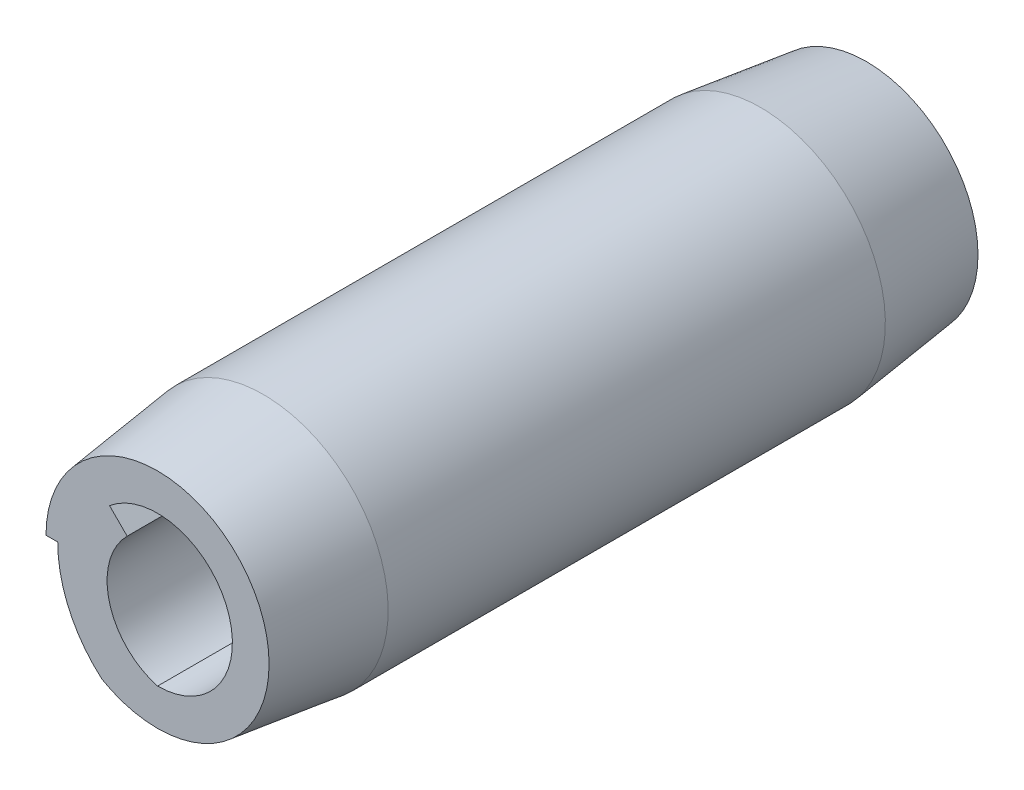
ISO-10303-21;
HEADER;
FILE_DESCRIPTION(('STEP AP214'),'2;1');
FILE_NAME('part.step','',(''),(''),'','','');
FILE_SCHEMA(('AUTOMOTIVE_DESIGN { 1 0 10303 214 1 1 1 1 }'));
ENDSEC;
DATA;
#1=APPLICATION_CONTEXT('core data for automotive mechanical design processes');
#2=APPLICATION_PROTOCOL_DEFINITION('international standard','automotive_design',2000,#1);
#3=PRODUCT_CONTEXT('',#1,'mechanical');
#4=PRODUCT('Part','Part','',(#3));
#5=PRODUCT_RELATED_PRODUCT_CATEGORY('part','',(#4));
#6=PRODUCT_DEFINITION_FORMATION('','',#4);
#7=PRODUCT_DEFINITION_CONTEXT('part definition',#1,'design');
#8=PRODUCT_DEFINITION('design','',#6,#7);
#9=PRODUCT_DEFINITION_SHAPE('','',#8);
#10=(LENGTH_UNIT() NAMED_UNIT(*) SI_UNIT(.MILLI.,.METRE.));
#11=(NAMED_UNIT(*) PLANE_ANGLE_UNIT() SI_UNIT($,.RADIAN.));
#12=(NAMED_UNIT(*) SI_UNIT($,.STERADIAN.) SOLID_ANGLE_UNIT());
#13=UNCERTAINTY_MEASURE_WITH_UNIT(LENGTH_MEASURE(1.E-05),#10,'distance_accuracy_value','');
#14=(GEOMETRIC_REPRESENTATION_CONTEXT(3) GLOBAL_UNCERTAINTY_ASSIGNED_CONTEXT((#13)) GLOBAL_UNIT_ASSIGNED_CONTEXT((#10,
#11,#12)) REPRESENTATION_CONTEXT('',''));
#15=CARTESIAN_POINT('',(0.,0.,0.));
#16=DIRECTION('',(0.,0.,1.));
#17=DIRECTION('',(1.,0.,0.));
#18=AXIS2_PLACEMENT_3D('',#15,#16,#17);
#19=CARTESIAN_POINT('',(0.,0.,2.38125));
#20=DIRECTION('',(0.,0.,-1.));
#21=DIRECTION('',(-1.,0.,0.));
#22=AXIS2_PLACEMENT_3D('',#19,#20,#21);
#23=PLANE('',#22);
#24=CARTESIAN_POINT('',(0.,0.,2.38125));
#25=DIRECTION('',(0.,0.,1.));
#26=DIRECTION('',(-1.,0.,0.));
#27=AXIS2_PLACEMENT_3D('',#24,#25,#26);
#28=CIRCLE('',#27,0.50292);
#29=CARTESIAN_POINT('',(0.,-0.50292,2.38125));
#30=VERTEX_POINT('',#29);
#31=CARTESIAN_POINT('',(-0.322595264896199,0.385824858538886,2.38125));
#32=VERTEX_POINT('',#31);
#33=EDGE_CURVE('E188',#30,#32,#28,.T.);
#34=ORIENTED_EDGE('',*,*,#33,.F.);
#35=CARTESIAN_POINT('',(0.121757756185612,-0.0585281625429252,2.38125));
#36=DIRECTION('',(0.,0.,1.));
#37=DIRECTION('',(-1.,0.,0.));
#38=AXIS2_PLACEMENT_3D('',#35,#36,#37);
#39=CIRCLE('',#38,0.460770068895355);
#40=CARTESIAN_POINT('',(-0.204055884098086,0.267285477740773,2.38125));
#41=VERTEX_POINT('',#40);
#42=EDGE_CURVE('E197',#41,#30,#39,.T.);
#43=ORIENTED_EDGE('',*,*,#42,.F.);
#44=DIRECTION('',(0.707106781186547,-0.707106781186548,0.));
#45=VECTOR('',#44,1.);
#46=CARTESIAN_POINT('',(-0.322595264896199,0.385824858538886,2.38125));
#47=LINE('',#46,#45);
#48=EDGE_CURVE('E190',#32,#41,#47,.T.);
#49=ORIENTED_EDGE('',*,*,#48,.F.);
#50=EDGE_LOOP('',(#34,#43,#49));
#51=FACE_BOUND('',#50,.T.);
#52=CARTESIAN_POINT('',(0.188595,0.,2.38125));
#53=DIRECTION('',(0.,0.,1.));
#54=DIRECTION('',(-1.,0.,0.));
#55=AXIS2_PLACEMENT_3D('',#52,#53,#54);
#56=CIRCLE('',#55,0.859155);
#57=CARTESIAN_POINT('',(-0.67056,0.,2.38125));
#58=VERTEX_POINT('',#57);
#59=CARTESIAN_POINT('',(-0.37415824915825,-0.649196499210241,2.38125));
#60=VERTEX_POINT('',#59);
#61=EDGE_CURVE('E138',#58,#60,#56,.T.);
#62=ORIENTED_EDGE('',*,*,#61,.T.);
#63=CARTESIAN_POINT('',(0.,0.,2.38125));
#64=DIRECTION('',(0.,0.,-1.));
#65=DIRECTION('',(-1.,0.,0.));
#66=AXIS2_PLACEMENT_3D('',#63,#64,#65);
#67=CIRCLE('',#66,0.7493);
#68=CARTESIAN_POINT('',(-0.7493,0.,2.38125));
#69=VERTEX_POINT('',#68);
#70=EDGE_CURVE('E60',#69,#60,#67,.T.);
#71=ORIENTED_EDGE('',*,*,#70,.F.);
#72=DIRECTION('',(1.,0.,0.));
#73=VECTOR('',#72,1.);
#74=CARTESIAN_POINT('',(-0.8382,0.,2.38125));
#75=LINE('',#74,#73);
#76=EDGE_CURVE('E132',#69,#58,#75,.T.);
#77=ORIENTED_EDGE('',*,*,#76,.T.);
#78=EDGE_LOOP('',(#62,#71,#77));
#79=FACE_BOUND('',#78,.T.);
#80=ADVANCED_FACE('F39',(#51,#79),#23,.F.);
#81=CARTESIAN_POINT('',(0.,0.,-2.38125));
#82=DIRECTION('',(0.,0.,-1.));
#83=DIRECTION('',(-1.,0.,0.));
#84=AXIS2_PLACEMENT_3D('',#81,#82,#83);
#85=PLANE('',#84);
#86=CARTESIAN_POINT('',(0.121757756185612,-0.0585281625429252,-2.38125));
#87=DIRECTION('',(0.,0.,1.));
#88=DIRECTION('',(-1.,0.,0.));
#89=AXIS2_PLACEMENT_3D('',#86,#87,#88);
#90=CIRCLE('',#89,0.460770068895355);
#91=CARTESIAN_POINT('',(-0.204055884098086,0.267285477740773,-2.38125));
#92=VERTEX_POINT('',#91);
#93=CARTESIAN_POINT('',(0.,-0.50292,-2.38125));
#94=VERTEX_POINT('',#93);
#95=EDGE_CURVE('E184',#92,#94,#90,.T.);
#96=ORIENTED_EDGE('',*,*,#95,.T.);
#97=CARTESIAN_POINT('',(0.,0.,-2.38125));
#98=DIRECTION('',(0.,0.,1.));
#99=DIRECTION('',(-1.,0.,0.));
#100=AXIS2_PLACEMENT_3D('',#97,#98,#99);
#101=CIRCLE('',#100,0.50292);
#102=CARTESIAN_POINT('',(-0.322595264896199,0.385824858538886,-2.38125));
#103=VERTEX_POINT('',#102);
#104=EDGE_CURVE('E185',#94,#103,#101,.T.);
#105=ORIENTED_EDGE('',*,*,#104,.T.);
#106=DIRECTION('',(0.707106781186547,-0.707106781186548,0.));
#107=VECTOR('',#106,1.);
#108=CARTESIAN_POINT('',(-0.322595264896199,0.385824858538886,-2.38125));
#109=LINE('',#108,#107);
#110=EDGE_CURVE('E186',#103,#92,#109,.T.);
#111=ORIENTED_EDGE('',*,*,#110,.T.);
#112=EDGE_LOOP('',(#96,#105,#111));
#113=FACE_BOUND('',#112,.T.);
#114=CARTESIAN_POINT('',(0.,0.,-2.38125));
#115=DIRECTION('',(0.,0.,-1.));
#116=DIRECTION('',(-1.,0.,0.));
#117=AXIS2_PLACEMENT_3D('',#114,#115,#116);
#118=CIRCLE('',#117,0.7493);
#119=CARTESIAN_POINT('',(-0.7493,0.,-2.38125));
#120=VERTEX_POINT('',#119);
#121=CARTESIAN_POINT('',(-0.37415824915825,-0.649196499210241,-2.38125));
#122=VERTEX_POINT('',#121);
#123=EDGE_CURVE('E107',#120,#122,#118,.T.);
#124=ORIENTED_EDGE('',*,*,#123,.T.);
#125=CARTESIAN_POINT('',(0.188595,0.,-2.38125));
#126=DIRECTION('',(0.,0.,1.));
#127=DIRECTION('',(-1.,0.,0.));
#128=AXIS2_PLACEMENT_3D('',#125,#126,#127);
#129=CIRCLE('',#128,0.859155);
#130=CARTESIAN_POINT('',(-0.67056,0.,-2.38125));
#131=VERTEX_POINT('',#130);
#132=EDGE_CURVE('E129',#131,#122,#129,.T.);
#133=ORIENTED_EDGE('',*,*,#132,.F.);
#134=DIRECTION('',(1.,0.,0.));
#135=VECTOR('',#134,1.);
#136=CARTESIAN_POINT('',(-0.8382,0.,-2.38125));
#137=LINE('',#136,#135);
#138=EDGE_CURVE('E121',#120,#131,#137,.T.);
#139=ORIENTED_EDGE('',*,*,#138,.F.);
#140=EDGE_LOOP('',(#124,#133,#139));
#141=FACE_BOUND('',#140,.T.);
#142=ADVANCED_FACE('F128',(#113,#141),#85,.T.);
#143=CARTESIAN_POINT('',(0.,0.,2.38125));
#144=DIRECTION('',(0.,0.,-1.));
#145=DIRECTION('',(-1.,0.,0.));
#146=AXIS2_PLACEMENT_3D('',#143,#144,#145);
#147=CYLINDRICAL_SURFACE('',#146,0.8382);
#148=DIRECTION('',(0.,0.,-1.));
#149=VECTOR('',#148,1.);
#150=CARTESIAN_POINT('',(-0.8382,0.,2.38125));
#151=LINE('',#150,#149);
#152=CARTESIAN_POINT('',(-0.8382,0.,1.67005));
#153=VERTEX_POINT('',#152);
#154=CARTESIAN_POINT('',(-0.8382,0.,-1.67005));
#155=VERTEX_POINT('',#154);
#156=EDGE_CURVE('E125',#153,#155,#151,.T.);
#157=ORIENTED_EDGE('',*,*,#156,.F.);
#158=CARTESIAN_POINT('',(0.,0.,1.67005));
#159=DIRECTION('',(0.,0.,-1.));
#160=DIRECTION('',(-1.,0.,0.));
#161=AXIS2_PLACEMENT_3D('',#158,#159,#160);
#162=CIRCLE('',#161,0.8382);
#163=CARTESIAN_POINT('',(0.,-0.8382,1.67005));
#164=VERTEX_POINT('',#163);
#165=EDGE_CURVE('E204',#153,#164,#162,.T.);
#166=ORIENTED_EDGE('',*,*,#165,.T.);
#167=DIRECTION('',(0.,0.,-1.));
#168=VECTOR('',#167,1.);
#169=CARTESIAN_POINT('',(0.,-0.8382,2.38125));
#170=LINE('',#169,#168);
#171=CARTESIAN_POINT('',(0.,-0.8382,-1.67005));
#172=VERTEX_POINT('',#171);
#173=EDGE_CURVE('E141',#164,#172,#170,.T.);
#174=ORIENTED_EDGE('',*,*,#173,.T.);
#175=CARTESIAN_POINT('',(0.,0.,-1.67005));
#176=DIRECTION('',(0.,0.,-1.));
#177=DIRECTION('',(-1.,0.,0.));
#178=AXIS2_PLACEMENT_3D('',#175,#176,#177);
#179=CIRCLE('',#178,0.8382);
#180=EDGE_CURVE('E67',#155,#172,#179,.T.);
#181=ORIENTED_EDGE('',*,*,#180,.F.);
#182=EDGE_LOOP('',(#157,#166,#174,#181));
#183=FACE_BOUND('',#182,.T.);
#184=ADVANCED_FACE('F41',(#183),#147,.T.);
#185=CARTESIAN_POINT('',(-0.8382,0.,2.38125));
#186=DIRECTION('',(0.,1.,0.));
#187=DIRECTION('',(0.,0.,1.));
#188=AXIS2_PLACEMENT_3D('',#185,#186,#187);
#189=PLANE('',#188);
#190=ORIENTED_EDGE('',*,*,#76,.F.);
#191=DIRECTION('',(0.124034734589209,0.,0.992277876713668));
#192=VECTOR('',#191,1.);
#193=CARTESIAN_POINT('',(0.,0.,8.37564999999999));
#194=LINE('',#193,#192);
#195=EDGE_CURVE('E126',#69,#153,#194,.F.);
#196=ORIENTED_EDGE('',*,*,#195,.T.);
#197=ORIENTED_EDGE('',*,*,#156,.T.);
#198=DIRECTION('',(-0.124034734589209,0.,0.992277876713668));
#199=VECTOR('',#198,1.);
#200=CARTESIAN_POINT('',(0.,0.,-8.37564999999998));
#201=LINE('',#200,#199);
#202=EDGE_CURVE('E110',#155,#120,#201,.F.);
#203=ORIENTED_EDGE('',*,*,#202,.T.);
#204=ORIENTED_EDGE('',*,*,#138,.T.);
#205=DIRECTION('',(0.,0.,-1.));
#206=VECTOR('',#205,1.);
#207=CARTESIAN_POINT('',(-0.67056,0.,2.38125));
#208=LINE('',#207,#206);
#209=EDGE_CURVE('E144',#58,#131,#208,.T.);
#210=ORIENTED_EDGE('',*,*,#209,.F.);
#211=EDGE_LOOP('',(#190,#196,#197,#203,#204,#210));
#212=FACE_BOUND('',#211,.T.);
#213=ADVANCED_FACE('F119',(#212),#189,.F.);
#214=CARTESIAN_POINT('',(0.188595,0.,2.38125));
#215=DIRECTION('',(0.,0.,-1.));
#216=DIRECTION('',(-1.,0.,0.));
#217=AXIS2_PLACEMENT_3D('',#214,#215,#216);
#218=CYLINDRICAL_SURFACE('',#217,0.859155);
#219=ORIENTED_EDGE('',*,*,#173,.F.);
#220=CARTESIAN_POINT('',(0.000111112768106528,-0.838224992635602,1.66984999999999));
#221=CARTESIAN_POINT('',(-0.0332708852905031,-0.830692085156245,1.72993119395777));
#222=CARTESIAN_POINT('',(-0.0662066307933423,-0.8212157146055,1.79002579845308));
#223=CARTESIAN_POINT('',(-0.130927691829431,-0.798272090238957,1.90973875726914));
#224=CARTESIAN_POINT('',(-0.162717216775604,-0.784821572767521,1.96935805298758));
#225=CARTESIAN_POINT('',(-0.225186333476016,-0.753756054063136,2.08815693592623));
#226=CARTESIAN_POINT('',(-0.255865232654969,-0.736138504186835,2.14733623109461));
#227=CARTESIAN_POINT('',(-0.300964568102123,-0.706261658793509,2.23556782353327));
#228=CARTESIAN_POINT('',(-0.315875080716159,-0.695701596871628,2.26495039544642));
#229=CARTESIAN_POINT('',(-0.345340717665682,-0.673350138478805,2.32343156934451));
#230=CARTESIAN_POINT('',(-0.359895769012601,-0.661558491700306,2.35253011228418));
#231=CARTESIAN_POINT('',(-0.374257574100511,-0.64911038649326,2.38144999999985));
#232=B_SPLINE_CURVE_WITH_KNOTS('',3,(#220,#221,#222,#223,#224,#225,#226,#227,#228,#229,#230,
#231),.UNSPECIFIED.,.F.,.F.,(4,2,2,2,2,4),(0.,0.207411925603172,0.413962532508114,
0.62063979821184,0.724418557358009,0.828218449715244),.UNSPECIFIED.);
#233=EDGE_CURVE('E11',#164,#60,#232,.T.);
#234=ORIENTED_EDGE('',*,*,#233,.T.);
#235=ORIENTED_EDGE('',*,*,#61,.F.);
#236=ORIENTED_EDGE('',*,*,#209,.T.);
#237=ORIENTED_EDGE('',*,*,#132,.T.);
#238=CARTESIAN_POINT('',(-0.374257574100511,-0.649110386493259,-2.38144999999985));
#239=CARTESIAN_POINT('',(-0.359895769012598,-0.661558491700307,-2.35253011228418));
#240=CARTESIAN_POINT('',(-0.345340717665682,-0.673350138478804,-2.32343156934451));
#241=CARTESIAN_POINT('',(-0.315875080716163,-0.695701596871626,-2.26495039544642));
#242=CARTESIAN_POINT('',(-0.300964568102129,-0.706261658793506,-2.23556782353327));
#243=CARTESIAN_POINT('',(-0.255865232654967,-0.736138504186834,-2.14733623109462));
#244=CARTESIAN_POINT('',(-0.22518633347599,-0.753756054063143,-2.08815693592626));
#245=CARTESIAN_POINT('',(-0.162717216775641,-0.784821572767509,-1.96935805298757));
#246=CARTESIAN_POINT('',(-0.130927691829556,-0.798272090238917,-1.90973875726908));
#247=CARTESIAN_POINT('',(-0.0662066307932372,-0.821215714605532,-1.79002579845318));
#248=CARTESIAN_POINT('',(-0.0332708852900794,-0.830692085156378,-1.72993119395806));
#249=CARTESIAN_POINT('',(0.000111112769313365,-0.83822499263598,-1.66985000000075));
#250=B_SPLINE_CURVE_WITH_KNOTS('',3,(#238,#239,#240,#241,#242,#243,#244,#245,#246,#247,#248,
#249),.UNSPECIFIED.,.F.,.F.,(4,2,2,2,2,4),(0.,0.103799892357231,0.207578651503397,
0.414255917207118,0.62080652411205,0.828218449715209),.UNSPECIFIED.);
#251=EDGE_CURVE('E53',#122,#172,#250,.T.);
#252=ORIENTED_EDGE('',*,*,#251,.T.);
#253=EDGE_LOOP('',(#219,#234,#235,#236,#237,#252));
#254=FACE_BOUND('',#253,.T.);
#255=ADVANCED_FACE('F151',(#254),#218,.T.);
#256=CARTESIAN_POINT('',(0.,0.,2.38125));
#257=DIRECTION('',(0.,0.,-1.));
#258=DIRECTION('',(-1.,0.,0.));
#259=AXIS2_PLACEMENT_3D('',#256,#257,#258);
#260=CYLINDRICAL_SURFACE('',#259,0.50292);
#261=ORIENTED_EDGE('',*,*,#104,.F.);
#262=DIRECTION('',(0.,0.,-1.));
#263=VECTOR('',#262,1.);
#264=CARTESIAN_POINT('',(0.,-0.50292,2.38125));
#265=LINE('',#264,#263);
#266=EDGE_CURVE('E195',#30,#94,#265,.T.);
#267=ORIENTED_EDGE('',*,*,#266,.F.);
#268=ORIENTED_EDGE('',*,*,#33,.T.);
#269=DIRECTION('',(0.,0.,-1.));
#270=VECTOR('',#269,1.);
#271=CARTESIAN_POINT('',(-0.322595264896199,0.385824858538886,2.38125));
#272=LINE('',#271,#270);
#273=EDGE_CURVE('E130',#32,#103,#272,.T.);
#274=ORIENTED_EDGE('',*,*,#273,.T.);
#275=EDGE_LOOP('',(#261,#267,#268,#274));
#276=FACE_BOUND('',#275,.T.);
#277=ADVANCED_FACE('F167',(#276),#260,.F.);
#278=CARTESIAN_POINT('',(-0.322595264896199,0.385824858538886,2.38125));
#279=DIRECTION('',(0.707106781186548,0.707106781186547,0.));
#280=DIRECTION('',(-0.707106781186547,0.707106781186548,0.));
#281=AXIS2_PLACEMENT_3D('',#278,#279,#280);
#282=PLANE('',#281);
#283=ORIENTED_EDGE('',*,*,#110,.F.);
#284=ORIENTED_EDGE('',*,*,#273,.F.);
#285=ORIENTED_EDGE('',*,*,#48,.T.);
#286=DIRECTION('',(0.,0.,-1.));
#287=VECTOR('',#286,1.);
#288=CARTESIAN_POINT('',(-0.204055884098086,0.267285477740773,2.38125));
#289=LINE('',#288,#287);
#290=EDGE_CURVE('E135',#41,#92,#289,.T.);
#291=ORIENTED_EDGE('',*,*,#290,.T.);
#292=EDGE_LOOP('',(#283,#284,#285,#291));
#293=FACE_BOUND('',#292,.T.);
#294=ADVANCED_FACE('F163',(#293),#282,.T.);
#295=CARTESIAN_POINT('',(0.121757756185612,-0.0585281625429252,2.38125));
#296=DIRECTION('',(0.,0.,-1.));
#297=DIRECTION('',(-1.,0.,0.));
#298=AXIS2_PLACEMENT_3D('',#295,#296,#297);
#299=CYLINDRICAL_SURFACE('',#298,0.460770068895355);
#300=ORIENTED_EDGE('',*,*,#95,.F.);
#301=ORIENTED_EDGE('',*,*,#290,.F.);
#302=ORIENTED_EDGE('',*,*,#42,.T.);
#303=ORIENTED_EDGE('',*,*,#266,.T.);
#304=EDGE_LOOP('',(#300,#301,#302,#303));
#305=FACE_BOUND('',#304,.T.);
#306=ADVANCED_FACE('F157',(#305),#299,.F.);
#307=CARTESIAN_POINT('',(0.,0.,-1.67005));
#308=DIRECTION('',(0.,0.,1.));
#309=DIRECTION('',(1.,0.,0.));
#310=AXIS2_PLACEMENT_3D('',#307,#308,#309);
#311=CONICAL_SURFACE('',#310,0.8382,0.124354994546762);
#312=ORIENTED_EDGE('',*,*,#180,.T.);
#313=ORIENTED_EDGE('',*,*,#251,.F.);
#314=ORIENTED_EDGE('',*,*,#123,.F.);
#315=ORIENTED_EDGE('',*,*,#202,.F.);
#316=EDGE_LOOP('',(#312,#313,#314,#315));
#317=FACE_BOUND('',#316,.T.);
#318=ADVANCED_FACE('F109',(#317),#311,.T.);
#319=CARTESIAN_POINT('',(0.,0.,2.38125));
#320=DIRECTION('',(0.,0.,-1.));
#321=DIRECTION('',(-1.,0.,0.));
#322=AXIS2_PLACEMENT_3D('',#319,#320,#321);
#323=CONICAL_SURFACE('',#322,0.7493,0.124354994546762);
#324=ORIENTED_EDGE('',*,*,#70,.T.);
#325=ORIENTED_EDGE('',*,*,#233,.F.);
#326=ORIENTED_EDGE('',*,*,#165,.F.);
#327=ORIENTED_EDGE('',*,*,#195,.F.);
#328=EDGE_LOOP('',(#324,#325,#326,#327));
#329=FACE_BOUND('',#328,.T.);
#330=ADVANCED_FACE('F156',(#329),#323,.T.);
#331=CLOSED_SHELL('',(#80,#142,#184,#213,#255,#277,#294,#306,#318,#330));
#332=MANIFOLD_SOLID_BREP('B2',#331);
#333=ADVANCED_BREP_SHAPE_REPRESENTATION('',(#18,#332),#14);
#334=SHAPE_DEFINITION_REPRESENTATION(#9,#333);
ENDSEC;
END-ISO-10303-21;
